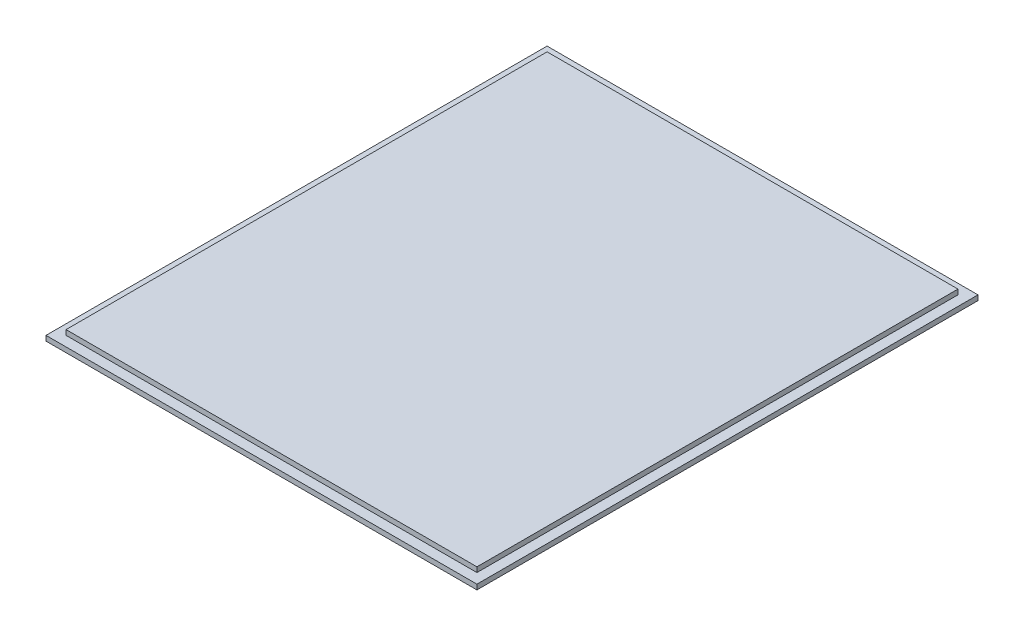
ISO-10303-21;
HEADER;
FILE_DESCRIPTION(('STEP AP214'),'2;1');
FILE_NAME('part.step','',(''),(''),'','','');
FILE_SCHEMA(('AUTOMOTIVE_DESIGN { 1 0 10303 214 1 1 1 1 }'));
ENDSEC;
DATA;
#1=APPLICATION_CONTEXT('core data for automotive mechanical design processes');
#2=APPLICATION_PROTOCOL_DEFINITION('international standard','automotive_design',2000,#1);
#3=PRODUCT_CONTEXT('',#1,'mechanical');
#4=PRODUCT('Part','Part','',(#3));
#5=PRODUCT_RELATED_PRODUCT_CATEGORY('part','',(#4));
#6=PRODUCT_DEFINITION_FORMATION('','',#4);
#7=PRODUCT_DEFINITION_CONTEXT('part definition',#1,'design');
#8=PRODUCT_DEFINITION('design','',#6,#7);
#9=PRODUCT_DEFINITION_SHAPE('','',#8);
#10=(LENGTH_UNIT() NAMED_UNIT(*) SI_UNIT(.MILLI.,.METRE.));
#11=(NAMED_UNIT(*) PLANE_ANGLE_UNIT() SI_UNIT($,.RADIAN.));
#12=(NAMED_UNIT(*) SI_UNIT($,.STERADIAN.) SOLID_ANGLE_UNIT());
#13=UNCERTAINTY_MEASURE_WITH_UNIT(LENGTH_MEASURE(1.E-05),#10,'distance_accuracy_value','');
#14=(GEOMETRIC_REPRESENTATION_CONTEXT(3) GLOBAL_UNCERTAINTY_ASSIGNED_CONTEXT((#13)) GLOBAL_UNIT_ASSIGNED_CONTEXT((#10,
#11,#12)) REPRESENTATION_CONTEXT('',''));
#15=CARTESIAN_POINT('',(0.,0.,0.));
#16=DIRECTION('',(0.,0.,1.));
#17=DIRECTION('',(1.,0.,0.));
#18=AXIS2_PLACEMENT_3D('',#15,#16,#17);
#19=CARTESIAN_POINT('',(136.525,6.35,-158.75));
#20=DIRECTION('',(-1.,0.,0.));
#21=DIRECTION('',(0.,0.,1.));
#22=AXIS2_PLACEMENT_3D('',#19,#20,#21);
#23=PLANE('',#22);
#24=DIRECTION('',(0.,0.,-1.));
#25=VECTOR('',#24,1.);
#26=CARTESIAN_POINT('',(136.525,3.175,-158.75));
#27=LINE('',#26,#25);
#28=CARTESIAN_POINT('',(136.525,3.175,158.75));
#29=VERTEX_POINT('',#28);
#30=CARTESIAN_POINT('',(136.525,3.175,-158.75));
#31=VERTEX_POINT('',#30);
#32=EDGE_CURVE('E144',#29,#31,#27,.T.);
#33=ORIENTED_EDGE('',*,*,#32,.F.);
#34=DIRECTION('',(0.,-1.,0.));
#35=VECTOR('',#34,1.);
#36=CARTESIAN_POINT('',(136.525,6.35,158.75));
#37=LINE('',#36,#35);
#38=CARTESIAN_POINT('',(136.525,0.,158.75));
#39=VERTEX_POINT('',#38);
#40=EDGE_CURVE('E158',#29,#39,#37,.T.);
#41=ORIENTED_EDGE('',*,*,#40,.T.);
#42=DIRECTION('',(0.,0.,-1.));
#43=VECTOR('',#42,1.);
#44=CARTESIAN_POINT('',(136.525,0.,-158.75));
#45=LINE('',#44,#43);
#46=CARTESIAN_POINT('',(136.525,0.,-158.75));
#47=VERTEX_POINT('',#46);
#48=EDGE_CURVE('E146',#39,#47,#45,.T.);
#49=ORIENTED_EDGE('',*,*,#48,.T.);
#50=DIRECTION('',(0.,-1.,0.));
#51=VECTOR('',#50,1.);
#52=CARTESIAN_POINT('',(136.525,6.35,-158.75));
#53=LINE('',#52,#51);
#54=EDGE_CURVE('E45',#31,#47,#53,.T.);
#55=ORIENTED_EDGE('',*,*,#54,.F.);
#56=EDGE_LOOP('',(#33,#41,#49,#55));
#57=FACE_BOUND('',#56,.T.);
#58=ADVANCED_FACE('F38',(#57),#23,.F.);
#59=CARTESIAN_POINT('',(-136.525,6.35,-158.75));
#60=DIRECTION('',(0.,0.,1.));
#61=DIRECTION('',(1.,0.,0.));
#62=AXIS2_PLACEMENT_3D('',#59,#60,#61);
#63=PLANE('',#62);
#64=DIRECTION('',(-1.,0.,0.));
#65=VECTOR('',#64,1.);
#66=CARTESIAN_POINT('',(-136.525,3.175,-158.75));
#67=LINE('',#66,#65);
#68=CARTESIAN_POINT('',(-136.525,3.175,-158.75));
#69=VERTEX_POINT('',#68);
#70=EDGE_CURVE('E142',#31,#69,#67,.T.);
#71=ORIENTED_EDGE('',*,*,#70,.F.);
#72=ORIENTED_EDGE('',*,*,#54,.T.);
#73=DIRECTION('',(-1.,0.,0.));
#74=VECTOR('',#73,1.);
#75=CARTESIAN_POINT('',(-136.525,0.,-158.75));
#76=LINE('',#75,#74);
#77=CARTESIAN_POINT('',(-136.525,0.,-158.75));
#78=VERTEX_POINT('',#77);
#79=EDGE_CURVE('E149',#47,#78,#76,.T.);
#80=ORIENTED_EDGE('',*,*,#79,.T.);
#81=DIRECTION('',(0.,-1.,0.));
#82=VECTOR('',#81,1.);
#83=CARTESIAN_POINT('',(-136.525,6.35,-158.75));
#84=LINE('',#83,#82);
#85=EDGE_CURVE('E162',#69,#78,#84,.T.);
#86=ORIENTED_EDGE('',*,*,#85,.F.);
#87=EDGE_LOOP('',(#71,#72,#80,#86));
#88=FACE_BOUND('',#87,.T.);
#89=ADVANCED_FACE('F167',(#88),#63,.F.);
#90=CARTESIAN_POINT('',(-136.525,6.35,-158.75));
#91=DIRECTION('',(1.,0.,0.));
#92=DIRECTION('',(0.,0.,-1.));
#93=AXIS2_PLACEMENT_3D('',#90,#91,#92);
#94=PLANE('',#93);
#95=DIRECTION('',(0.,0.,1.));
#96=VECTOR('',#95,1.);
#97=CARTESIAN_POINT('',(-136.525,3.175,-158.75));
#98=LINE('',#97,#96);
#99=CARTESIAN_POINT('',(-136.525,3.175,158.75));
#100=VERTEX_POINT('',#99);
#101=EDGE_CURVE('E51',#69,#100,#98,.T.);
#102=ORIENTED_EDGE('',*,*,#101,.F.);
#103=ORIENTED_EDGE('',*,*,#85,.T.);
#104=DIRECTION('',(0.,0.,1.));
#105=VECTOR('',#104,1.);
#106=CARTESIAN_POINT('',(-136.525,0.,-158.75));
#107=LINE('',#106,#105);
#108=CARTESIAN_POINT('',(-136.525,0.,158.75));
#109=VERTEX_POINT('',#108);
#110=EDGE_CURVE('E152',#78,#109,#107,.T.);
#111=ORIENTED_EDGE('',*,*,#110,.T.);
#112=DIRECTION('',(0.,-1.,0.));
#113=VECTOR('',#112,1.);
#114=CARTESIAN_POINT('',(-136.525,6.35,158.75));
#115=LINE('',#114,#113);
#116=EDGE_CURVE('E160',#100,#109,#115,.T.);
#117=ORIENTED_EDGE('',*,*,#116,.F.);
#118=EDGE_LOOP('',(#102,#103,#111,#117));
#119=FACE_BOUND('',#118,.T.);
#120=ADVANCED_FACE('F181',(#119),#94,.F.);
#121=CARTESIAN_POINT('',(-136.525,6.35,158.75));
#122=DIRECTION('',(0.,0.,-1.));
#123=DIRECTION('',(-1.,0.,0.));
#124=AXIS2_PLACEMENT_3D('',#121,#122,#123);
#125=PLANE('',#124);
#126=DIRECTION('',(1.,0.,0.));
#127=VECTOR('',#126,1.);
#128=CARTESIAN_POINT('',(-136.525,3.175,158.75));
#129=LINE('',#128,#127);
#130=EDGE_CURVE('E12',#100,#29,#129,.T.);
#131=ORIENTED_EDGE('',*,*,#130,.F.);
#132=ORIENTED_EDGE('',*,*,#116,.T.);
#133=DIRECTION('',(1.,0.,0.));
#134=VECTOR('',#133,1.);
#135=CARTESIAN_POINT('',(-136.525,0.,158.75));
#136=LINE('',#135,#134);
#137=EDGE_CURVE('E155',#109,#39,#136,.T.);
#138=ORIENTED_EDGE('',*,*,#137,.T.);
#139=ORIENTED_EDGE('',*,*,#40,.F.);
#140=EDGE_LOOP('',(#131,#132,#138,#139));
#141=FACE_BOUND('',#140,.T.);
#142=ADVANCED_FACE('F178',(#141),#125,.F.);
#143=CARTESIAN_POINT('',(0.,0.,0.));
#144=DIRECTION('',(0.,1.,0.));
#145=DIRECTION('',(0.,0.,1.));
#146=AXIS2_PLACEMENT_3D('',#143,#144,#145);
#147=PLANE('',#146);
#148=ORIENTED_EDGE('',*,*,#48,.F.);
#149=ORIENTED_EDGE('',*,*,#137,.F.);
#150=ORIENTED_EDGE('',*,*,#110,.F.);
#151=ORIENTED_EDGE('',*,*,#79,.F.);
#152=EDGE_LOOP('',(#148,#149,#150,#151));
#153=FACE_BOUND('',#152,.T.);
#154=ADVANCED_FACE('F174',(#153),#147,.F.);
#155=CARTESIAN_POINT('',(0.,3.175,0.));
#156=DIRECTION('',(0.,1.,0.));
#157=DIRECTION('',(0.,0.,1.));
#158=AXIS2_PLACEMENT_3D('',#155,#156,#157);
#159=PLANE('',#158);
#160=DIRECTION('',(1.,0.,0.));
#161=VECTOR('',#160,1.);
#162=CARTESIAN_POINT('',(-130.175,3.175,152.4));
#163=LINE('',#162,#161);
#164=CARTESIAN_POINT('',(-130.175,3.175,152.4));
#165=VERTEX_POINT('',#164);
#166=CARTESIAN_POINT('',(130.175,3.175,152.4));
#167=VERTEX_POINT('',#166);
#168=EDGE_CURVE('E113',#165,#167,#163,.T.);
#169=ORIENTED_EDGE('',*,*,#168,.F.);
#170=DIRECTION('',(0.,0.,1.));
#171=VECTOR('',#170,1.);
#172=CARTESIAN_POINT('',(-130.175,3.175,152.4));
#173=LINE('',#172,#171);
#174=CARTESIAN_POINT('',(-130.175,3.175,-152.4));
#175=VERTEX_POINT('',#174);
#176=EDGE_CURVE('E122',#175,#165,#173,.T.);
#177=ORIENTED_EDGE('',*,*,#176,.F.);
#178=DIRECTION('',(-1.,0.,0.));
#179=VECTOR('',#178,1.);
#180=CARTESIAN_POINT('',(-130.175,3.175,-152.4));
#181=LINE('',#180,#179);
#182=CARTESIAN_POINT('',(130.175,3.175,-152.4));
#183=VERTEX_POINT('',#182);
#184=EDGE_CURVE('E105',#183,#175,#181,.T.);
#185=ORIENTED_EDGE('',*,*,#184,.F.);
#186=DIRECTION('',(0.,0.,-1.));
#187=VECTOR('',#186,1.);
#188=CARTESIAN_POINT('',(130.175,3.175,152.4));
#189=LINE('',#188,#187);
#190=EDGE_CURVE('E119',#167,#183,#189,.T.);
#191=ORIENTED_EDGE('',*,*,#190,.F.);
#192=EDGE_LOOP('',(#169,#177,#185,#191));
#193=FACE_BOUND('',#192,.T.);
#194=ORIENTED_EDGE('',*,*,#32,.T.);
#195=ORIENTED_EDGE('',*,*,#70,.T.);
#196=ORIENTED_EDGE('',*,*,#101,.T.);
#197=ORIENTED_EDGE('',*,*,#130,.T.);
#198=EDGE_LOOP('',(#194,#195,#196,#197));
#199=FACE_BOUND('',#198,.T.);
#200=ADVANCED_FACE('F118',(#193,#199),#159,.T.);
#201=CARTESIAN_POINT('',(130.175,3.175,152.4));
#202=DIRECTION('',(1.,0.,0.));
#203=DIRECTION('',(0.,0.,-1.));
#204=AXIS2_PLACEMENT_3D('',#201,#202,#203);
#205=PLANE('',#204);
#206=DIRECTION('',(0.,0.,-1.));
#207=VECTOR('',#206,1.);
#208=CARTESIAN_POINT('',(130.175,6.35,152.4));
#209=LINE('',#208,#207);
#210=CARTESIAN_POINT('',(130.175,6.35,152.4));
#211=VERTEX_POINT('',#210);
#212=CARTESIAN_POINT('',(130.175,6.35,-152.4));
#213=VERTEX_POINT('',#212);
#214=EDGE_CURVE('E133',#211,#213,#209,.T.);
#215=ORIENTED_EDGE('',*,*,#214,.F.);
#216=DIRECTION('',(0.,1.,0.));
#217=VECTOR('',#216,1.);
#218=CARTESIAN_POINT('',(130.175,3.175,152.4));
#219=LINE('',#218,#217);
#220=EDGE_CURVE('E125',#167,#211,#219,.T.);
#221=ORIENTED_EDGE('',*,*,#220,.F.);
#222=ORIENTED_EDGE('',*,*,#190,.T.);
#223=DIRECTION('',(0.,1.,0.));
#224=VECTOR('',#223,1.);
#225=CARTESIAN_POINT('',(130.175,3.175,-152.4));
#226=LINE('',#225,#224);
#227=EDGE_CURVE('E102',#183,#213,#226,.T.);
#228=ORIENTED_EDGE('',*,*,#227,.T.);
#229=EDGE_LOOP('',(#215,#221,#222,#228));
#230=FACE_BOUND('',#229,.T.);
#231=ADVANCED_FACE('F124',(#230),#205,.T.);
#232=CARTESIAN_POINT('',(-130.175,3.175,152.4));
#233=DIRECTION('',(0.,0.,1.));
#234=DIRECTION('',(1.,0.,0.));
#235=AXIS2_PLACEMENT_3D('',#232,#233,#234);
#236=PLANE('',#235);
#237=DIRECTION('',(1.,0.,0.));
#238=VECTOR('',#237,1.);
#239=CARTESIAN_POINT('',(-130.175,6.35,152.4));
#240=LINE('',#239,#238);
#241=CARTESIAN_POINT('',(-130.175,6.35,152.4));
#242=VERTEX_POINT('',#241);
#243=EDGE_CURVE('E126',#242,#211,#240,.T.);
#244=ORIENTED_EDGE('',*,*,#243,.F.);
#245=DIRECTION('',(0.,1.,0.));
#246=VECTOR('',#245,1.);
#247=CARTESIAN_POINT('',(-130.175,3.175,152.4));
#248=LINE('',#247,#246);
#249=EDGE_CURVE('E138',#165,#242,#248,.T.);
#250=ORIENTED_EDGE('',*,*,#249,.F.);
#251=ORIENTED_EDGE('',*,*,#168,.T.);
#252=ORIENTED_EDGE('',*,*,#220,.T.);
#253=EDGE_LOOP('',(#244,#250,#251,#252));
#254=FACE_BOUND('',#253,.T.);
#255=ADVANCED_FACE('F228',(#254),#236,.T.);
#256=CARTESIAN_POINT('',(-130.175,3.175,152.4));
#257=DIRECTION('',(-1.,0.,0.));
#258=DIRECTION('',(0.,0.,1.));
#259=AXIS2_PLACEMENT_3D('',#256,#257,#258);
#260=PLANE('',#259);
#261=DIRECTION('',(0.,0.,1.));
#262=VECTOR('',#261,1.);
#263=CARTESIAN_POINT('',(-130.175,6.35,152.4));
#264=LINE('',#263,#262);
#265=CARTESIAN_POINT('',(-130.175,6.35,-152.4));
#266=VERTEX_POINT('',#265);
#267=EDGE_CURVE('E59',#266,#242,#264,.T.);
#268=ORIENTED_EDGE('',*,*,#267,.F.);
#269=DIRECTION('',(0.,1.,0.));
#270=VECTOR('',#269,1.);
#271=CARTESIAN_POINT('',(-130.175,3.175,-152.4));
#272=LINE('',#271,#270);
#273=EDGE_CURVE('E112',#175,#266,#272,.T.);
#274=ORIENTED_EDGE('',*,*,#273,.F.);
#275=ORIENTED_EDGE('',*,*,#176,.T.);
#276=ORIENTED_EDGE('',*,*,#249,.T.);
#277=EDGE_LOOP('',(#268,#274,#275,#276));
#278=FACE_BOUND('',#277,.T.);
#279=ADVANCED_FACE('F238',(#278),#260,.T.);
#280=CARTESIAN_POINT('',(-130.175,3.175,-152.4));
#281=DIRECTION('',(0.,0.,-1.));
#282=DIRECTION('',(-1.,0.,0.));
#283=AXIS2_PLACEMENT_3D('',#280,#281,#282);
#284=PLANE('',#283);
#285=DIRECTION('',(-1.,0.,0.));
#286=VECTOR('',#285,1.);
#287=CARTESIAN_POINT('',(-130.175,6.35,-152.4));
#288=LINE('',#287,#286);
#289=EDGE_CURVE('E107',#213,#266,#288,.T.);
#290=ORIENTED_EDGE('',*,*,#289,.F.);
#291=ORIENTED_EDGE('',*,*,#227,.F.);
#292=ORIENTED_EDGE('',*,*,#184,.T.);
#293=ORIENTED_EDGE('',*,*,#273,.T.);
#294=EDGE_LOOP('',(#290,#291,#292,#293));
#295=FACE_BOUND('',#294,.T.);
#296=ADVANCED_FACE('F104',(#295),#284,.T.);
#297=CARTESIAN_POINT('',(0.,6.35,0.));
#298=DIRECTION('',(0.,1.,0.));
#299=DIRECTION('',(0.,0.,1.));
#300=AXIS2_PLACEMENT_3D('',#297,#298,#299);
#301=PLANE('',#300);
#302=ORIENTED_EDGE('',*,*,#243,.T.);
#303=ORIENTED_EDGE('',*,*,#214,.T.);
#304=ORIENTED_EDGE('',*,*,#289,.T.);
#305=ORIENTED_EDGE('',*,*,#267,.T.);
#306=EDGE_LOOP('',(#302,#303,#304,#305));
#307=FACE_BOUND('',#306,.T.);
#308=ADVANCED_FACE('F258',(#307),#301,.T.);
#309=CLOSED_SHELL('',(#58,#89,#120,#142,#154,#200,#231,#255,#279,#296,#308));
#310=MANIFOLD_SOLID_BREP('B2',#309);
#311=ADVANCED_BREP_SHAPE_REPRESENTATION('',(#18,#310),#14);
#312=SHAPE_DEFINITION_REPRESENTATION(#9,#311);
ENDSEC;
END-ISO-10303-21;
